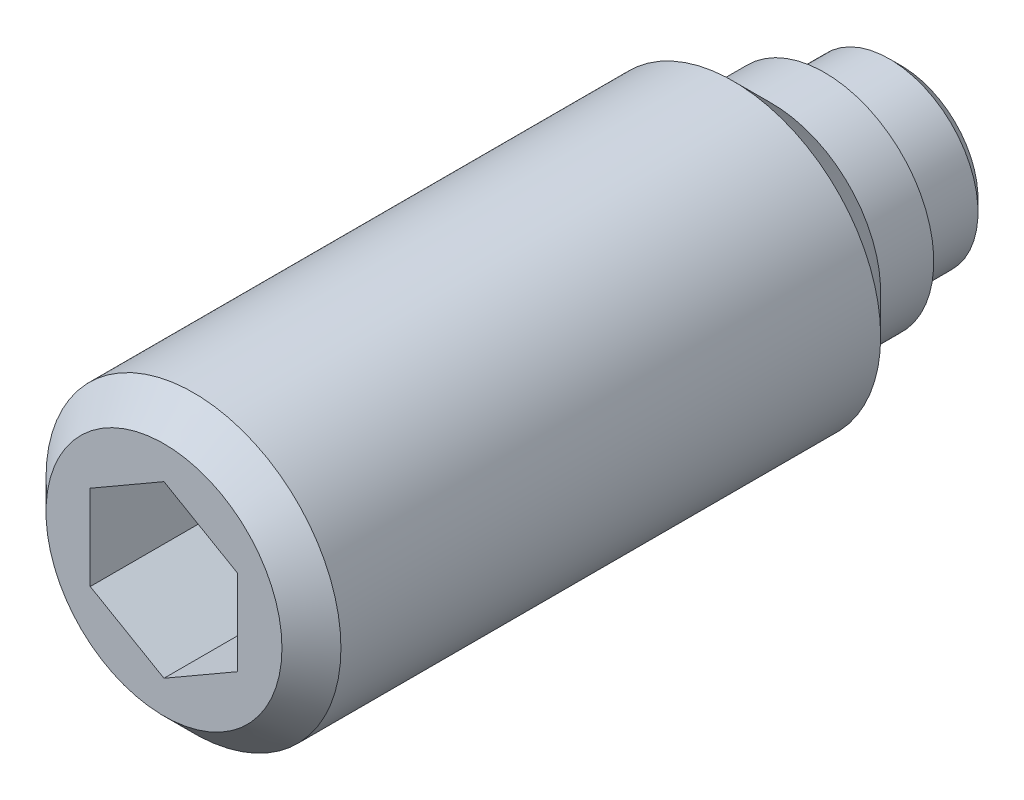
ISO-10303-21;
HEADER;
FILE_DESCRIPTION(('STEP AP214'),'2;1');
FILE_NAME('part.step','',(''),(''),'','','');
FILE_SCHEMA(('AUTOMOTIVE_DESIGN { 1 0 10303 214 1 1 1 1 }'));
ENDSEC;
DATA;
#1=APPLICATION_CONTEXT('core data for automotive mechanical design processes');
#2=APPLICATION_PROTOCOL_DEFINITION('international standard','automotive_design',2000,#1);
#3=PRODUCT_CONTEXT('',#1,'mechanical');
#4=PRODUCT('Part','Part','',(#3));
#5=PRODUCT_RELATED_PRODUCT_CATEGORY('part','',(#4));
#6=PRODUCT_DEFINITION_FORMATION('','',#4);
#7=PRODUCT_DEFINITION_CONTEXT('part definition',#1,'design');
#8=PRODUCT_DEFINITION('design','',#6,#7);
#9=PRODUCT_DEFINITION_SHAPE('','',#8);
#10=(LENGTH_UNIT() NAMED_UNIT(*) SI_UNIT(.MILLI.,.METRE.));
#11=(NAMED_UNIT(*) PLANE_ANGLE_UNIT() SI_UNIT($,.RADIAN.));
#12=(NAMED_UNIT(*) SI_UNIT($,.STERADIAN.) SOLID_ANGLE_UNIT());
#13=UNCERTAINTY_MEASURE_WITH_UNIT(LENGTH_MEASURE(1.E-05),#10,'distance_accuracy_value','');
#14=(GEOMETRIC_REPRESENTATION_CONTEXT(3) GLOBAL_UNCERTAINTY_ASSIGNED_CONTEXT((#13)) GLOBAL_UNIT_ASSIGNED_CONTEXT((#10,
#11,#12)) REPRESENTATION_CONTEXT('',''));
#15=CARTESIAN_POINT('',(0.,0.,0.));
#16=DIRECTION('',(0.,0.,1.));
#17=DIRECTION('',(1.,0.,0.));
#18=AXIS2_PLACEMENT_3D('',#15,#16,#17);
#19=CARTESIAN_POINT('',(0.,0.,1.3));
#20=DIRECTION('',(0.,0.,-1.));
#21=DIRECTION('',(-1.,0.,0.));
#22=AXIS2_PLACEMENT_3D('',#19,#20,#21);
#23=CYLINDRICAL_SURFACE('',#22,2.5);
#24=CARTESIAN_POINT('',(0.,0.,2.85));
#25=DIRECTION('',(0.,0.,-1.));
#26=DIRECTION('',(-1.,0.,0.));
#27=AXIS2_PLACEMENT_3D('',#24,#25,#26);
#28=CIRCLE('',#27,2.5);
#29=CARTESIAN_POINT('',(-2.5,0.,2.85));
#30=VERTEX_POINT('',#29);
#31=EDGE_CURVE('E9',#30,#30,#28,.T.);
#32=ORIENTED_EDGE('',*,*,#31,.F.);
#33=EDGE_LOOP('',(#32));
#34=FACE_BOUND('',#33,.T.);
#35=CARTESIAN_POINT('',(0.,0.,12.));
#36=DIRECTION('',(0.,0.,1.));
#37=DIRECTION('',(1.,0.,0.));
#38=AXIS2_PLACEMENT_3D('',#35,#36,#37);
#39=CIRCLE('',#38,2.5);
#40=CARTESIAN_POINT('',(2.5,0.,12.));
#41=VERTEX_POINT('',#40);
#42=EDGE_CURVE('E115',#41,#41,#39,.T.);
#43=ORIENTED_EDGE('',*,*,#42,.F.);
#44=EDGE_LOOP('',(#43));
#45=FACE_BOUND('',#44,.T.);
#46=ADVANCED_FACE('F14',(#34,#45),#23,.T.);
#47=CARTESIAN_POINT('',(0.,0.,2.85));
#48=DIRECTION('',(0.,0.,1.));
#49=DIRECTION('',(1.,0.,0.));
#50=AXIS2_PLACEMENT_3D('',#47,#48,#49);
#51=CONICAL_SURFACE('',#50,2.5,0.785398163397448);
#52=ORIENTED_EDGE('',*,*,#31,.T.);
#53=EDGE_LOOP('',(#52));
#54=FACE_BOUND('',#53,.T.);
#55=CARTESIAN_POINT('',(0.,0.,2.2));
#56=DIRECTION('',(0.,0.,-1.));
#57=DIRECTION('',(-1.,0.,0.));
#58=AXIS2_PLACEMENT_3D('',#55,#56,#57);
#59=CIRCLE('',#58,1.85);
#60=CARTESIAN_POINT('',(-1.85,0.,2.2));
#61=VERTEX_POINT('',#60);
#62=EDGE_CURVE('E21',#61,#61,#59,.T.);
#63=ORIENTED_EDGE('',*,*,#62,.F.);
#64=EDGE_LOOP('',(#63));
#65=FACE_BOUND('',#64,.T.);
#66=ADVANCED_FACE('F143',(#54,#65),#51,.T.);
#67=CARTESIAN_POINT('',(0.,0.,1.3));
#68=DIRECTION('',(0.,0.,-1.));
#69=DIRECTION('',(-1.,0.,0.));
#70=AXIS2_PLACEMENT_3D('',#67,#68,#69);
#71=CYLINDRICAL_SURFACE('',#70,1.85);
#72=ORIENTED_EDGE('',*,*,#62,.T.);
#73=EDGE_LOOP('',(#72));
#74=FACE_BOUND('',#73,.T.);
#75=CARTESIAN_POINT('',(0.,0.,1.3));
#76=DIRECTION('',(0.,0.,-1.));
#77=DIRECTION('',(-1.,0.,0.));
#78=AXIS2_PLACEMENT_3D('',#75,#76,#77);
#79=CIRCLE('',#78,1.85);
#80=CARTESIAN_POINT('',(-1.85,0.,1.3));
#81=VERTEX_POINT('',#80);
#82=EDGE_CURVE('E135',#81,#81,#79,.T.);
#83=ORIENTED_EDGE('',*,*,#82,.F.);
#84=EDGE_LOOP('',(#83));
#85=FACE_BOUND('',#84,.T.);
#86=ADVANCED_FACE('F140',(#74,#85),#71,.T.);
#87=CARTESIAN_POINT('',(0.,1.85,1.3));
#88=DIRECTION('',(0.,0.,1.));
#89=DIRECTION('',(1.,0.,0.));
#90=AXIS2_PLACEMENT_3D('',#87,#88,#89);
#91=PLANE('',#90);
#92=ORIENTED_EDGE('',*,*,#82,.T.);
#93=EDGE_LOOP('',(#92));
#94=FACE_BOUND('',#93,.T.);
#95=CARTESIAN_POINT('',(0.,0.,1.3));
#96=DIRECTION('',(0.,0.,-1.));
#97=DIRECTION('',(-1.,0.,0.));
#98=AXIS2_PLACEMENT_3D('',#95,#96,#97);
#99=CIRCLE('',#98,1.5);
#100=CARTESIAN_POINT('',(-1.5,0.,1.3));
#101=VERTEX_POINT('',#100);
#102=EDGE_CURVE('E132',#101,#101,#99,.T.);
#103=ORIENTED_EDGE('',*,*,#102,.F.);
#104=EDGE_LOOP('',(#103));
#105=FACE_BOUND('',#104,.T.);
#106=ADVANCED_FACE('F151',(#94,#105),#91,.F.);
#107=CARTESIAN_POINT('',(0.,0.,0.));
#108=DIRECTION('',(0.,0.,-1.));
#109=DIRECTION('',(-1.,0.,0.));
#110=AXIS2_PLACEMENT_3D('',#107,#108,#109);
#111=CYLINDRICAL_SURFACE('',#110,1.5);
#112=CARTESIAN_POINT('',(0.,0.,0.2));
#113=DIRECTION('',(0.,0.,-1.));
#114=DIRECTION('',(-1.,0.,0.));
#115=AXIS2_PLACEMENT_3D('',#112,#113,#114);
#116=CIRCLE('',#115,1.5);
#117=CARTESIAN_POINT('',(-1.5,0.,0.2));
#118=VERTEX_POINT('',#117);
#119=EDGE_CURVE('E129',#118,#118,#116,.T.);
#120=ORIENTED_EDGE('',*,*,#119,.F.);
#121=EDGE_LOOP('',(#120));
#122=FACE_BOUND('',#121,.T.);
#123=ORIENTED_EDGE('',*,*,#102,.T.);
#124=EDGE_LOOP('',(#123));
#125=FACE_BOUND('',#124,.T.);
#126=ADVANCED_FACE('F157',(#122,#125),#111,.T.);
#127=CARTESIAN_POINT('',(0.,0.,0.2));
#128=DIRECTION('',(0.,0.,1.));
#129=DIRECTION('',(1.,0.,0.));
#130=AXIS2_PLACEMENT_3D('',#127,#128,#129);
#131=CONICAL_SURFACE('',#130,1.5,0.785398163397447);
#132=CARTESIAN_POINT('',(0.,0.,0.));
#133=DIRECTION('',(0.,0.,-1.));
#134=DIRECTION('',(-1.,0.,0.));
#135=AXIS2_PLACEMENT_3D('',#132,#133,#134);
#136=CIRCLE('',#135,1.3);
#137=CARTESIAN_POINT('',(-1.3,0.,0.));
#138=VERTEX_POINT('',#137);
#139=EDGE_CURVE('E126',#138,#138,#136,.T.);
#140=ORIENTED_EDGE('',*,*,#139,.F.);
#141=EDGE_LOOP('',(#140));
#142=FACE_BOUND('',#141,.T.);
#143=ORIENTED_EDGE('',*,*,#119,.T.);
#144=EDGE_LOOP('',(#143));
#145=FACE_BOUND('',#144,.T.);
#146=ADVANCED_FACE('F161',(#142,#145),#131,.T.);
#147=CARTESIAN_POINT('',(0.,1.3,0.));
#148=DIRECTION('',(0.,0.,1.));
#149=DIRECTION('',(1.,0.,0.));
#150=AXIS2_PLACEMENT_3D('',#147,#148,#149);
#151=PLANE('',#150);
#152=ORIENTED_EDGE('',*,*,#139,.T.);
#153=EDGE_LOOP('',(#152));
#154=FACE_BOUND('',#153,.T.);
#155=ADVANCED_FACE('F165',(#154),#151,.F.);
#156=CARTESIAN_POINT('',(0.,0.,12.5));
#157=DIRECTION('',(0.,0.,1.));
#158=DIRECTION('',(1.,0.,0.));
#159=AXIS2_PLACEMENT_3D('',#156,#157,#158);
#160=PLANE('',#159);
#161=DIRECTION('',(0.866025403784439,-0.5,0.));
#162=VECTOR('',#161,1.);
#163=CARTESIAN_POINT('',(-1.25,-0.721687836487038,12.5));
#164=LINE('',#163,#162);
#165=CARTESIAN_POINT('',(-1.25,-0.721687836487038,12.5));
#166=VERTEX_POINT('',#165);
#167=CARTESIAN_POINT('',(0.,-1.44337567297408,12.5));
#168=VERTEX_POINT('',#167);
#169=EDGE_CURVE('E28',#166,#168,#164,.T.);
#170=ORIENTED_EDGE('',*,*,#169,.F.);
#171=DIRECTION('',(0.,-1.,0.));
#172=VECTOR('',#171,1.);
#173=CARTESIAN_POINT('',(-1.25,0.721687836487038,12.5));
#174=LINE('',#173,#172);
#175=CARTESIAN_POINT('',(-1.25,0.721687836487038,12.5));
#176=VERTEX_POINT('',#175);
#177=EDGE_CURVE('E111',#176,#166,#174,.T.);
#178=ORIENTED_EDGE('',*,*,#177,.F.);
#179=DIRECTION('',(-0.866025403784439,-0.5,0.));
#180=VECTOR('',#179,1.);
#181=CARTESIAN_POINT('',(0.,1.44337567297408,12.5));
#182=LINE('',#181,#180);
#183=CARTESIAN_POINT('',(0.,1.44337567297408,12.5));
#184=VERTEX_POINT('',#183);
#185=EDGE_CURVE('E109',#184,#176,#182,.T.);
#186=ORIENTED_EDGE('',*,*,#185,.F.);
#187=DIRECTION('',(-0.866025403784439,0.5,0.));
#188=VECTOR('',#187,1.);
#189=CARTESIAN_POINT('',(1.25,0.721687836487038,12.5));
#190=LINE('',#189,#188);
#191=CARTESIAN_POINT('',(1.25,0.721687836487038,12.5));
#192=VERTEX_POINT('',#191);
#193=EDGE_CURVE('E76',#192,#184,#190,.T.);
#194=ORIENTED_EDGE('',*,*,#193,.F.);
#195=DIRECTION('',(0.,1.,0.));
#196=VECTOR('',#195,1.);
#197=CARTESIAN_POINT('',(1.25,-0.721687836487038,12.5));
#198=LINE('',#197,#196);
#199=CARTESIAN_POINT('',(1.25,-0.721687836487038,12.5));
#200=VERTEX_POINT('',#199);
#201=EDGE_CURVE('E105',#200,#192,#198,.T.);
#202=ORIENTED_EDGE('',*,*,#201,.F.);
#203=DIRECTION('',(0.866025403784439,0.5,0.));
#204=VECTOR('',#203,1.);
#205=CARTESIAN_POINT('',(0.,-1.44337567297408,12.5));
#206=LINE('',#205,#204);
#207=EDGE_CURVE('E102',#168,#200,#206,.T.);
#208=ORIENTED_EDGE('',*,*,#207,.F.);
#209=EDGE_LOOP('',(#170,#178,#186,#194,#202,#208));
#210=FACE_BOUND('',#209,.T.);
#211=CARTESIAN_POINT('',(0.,0.,12.5));
#212=DIRECTION('',(0.,0.,1.));
#213=DIRECTION('',(1.,0.,0.));
#214=AXIS2_PLACEMENT_3D('',#211,#212,#213);
#215=CIRCLE('',#214,2.);
#216=CARTESIAN_POINT('',(2.,0.,12.5));
#217=VERTEX_POINT('',#216);
#218=EDGE_CURVE('E123',#217,#217,#215,.T.);
#219=ORIENTED_EDGE('',*,*,#218,.T.);
#220=EDGE_LOOP('',(#219));
#221=FACE_BOUND('',#220,.T.);
#222=ADVANCED_FACE('F169',(#210,#221),#160,.T.);
#223=CARTESIAN_POINT('',(0.,0.,12.5));
#224=DIRECTION('',(0.,0.,-1.));
#225=DIRECTION('',(-1.,0.,0.));
#226=AXIS2_PLACEMENT_3D('',#223,#224,#225);
#227=CONICAL_SURFACE('',#226,2.,0.785398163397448);
#228=ORIENTED_EDGE('',*,*,#42,.T.);
#229=EDGE_LOOP('',(#228));
#230=FACE_BOUND('',#229,.T.);
#231=ORIENTED_EDGE('',*,*,#218,.F.);
#232=EDGE_LOOP('',(#231));
#233=FACE_BOUND('',#232,.T.);
#234=ADVANCED_FACE('F173',(#230,#233),#227,.T.);
#235=CARTESIAN_POINT('',(-1.25,-0.721687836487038,9.5));
#236=DIRECTION('',(-0.5,-0.866025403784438,0.));
#237=DIRECTION('',(0.866025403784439,-0.5,0.));
#238=AXIS2_PLACEMENT_3D('',#235,#236,#237);
#239=PLANE('',#238);
#240=ORIENTED_EDGE('',*,*,#169,.T.);
#241=DIRECTION('',(0.,0.,1.));
#242=VECTOR('',#241,1.);
#243=CARTESIAN_POINT('',(0.,-1.44337567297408,9.5));
#244=LINE('',#243,#242);
#245=CARTESIAN_POINT('',(0.,-1.44337567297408,9.5));
#246=VERTEX_POINT('',#245);
#247=EDGE_CURVE('E58',#246,#168,#244,.T.);
#248=ORIENTED_EDGE('',*,*,#247,.F.);
#249=DIRECTION('',(0.866025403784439,-0.5,0.));
#250=VECTOR('',#249,1.);
#251=CARTESIAN_POINT('',(-1.25,-0.721687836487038,9.5));
#252=LINE('',#251,#250);
#253=CARTESIAN_POINT('',(-1.25,-0.721687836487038,9.5));
#254=VERTEX_POINT('',#253);
#255=EDGE_CURVE('E113',#254,#246,#252,.T.);
#256=ORIENTED_EDGE('',*,*,#255,.F.);
#257=DIRECTION('',(0.,0.,1.));
#258=VECTOR('',#257,1.);
#259=CARTESIAN_POINT('',(-1.25,-0.721687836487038,9.5));
#260=LINE('',#259,#258);
#261=EDGE_CURVE('E36',#254,#166,#260,.T.);
#262=ORIENTED_EDGE('',*,*,#261,.T.);
#263=EDGE_LOOP('',(#240,#248,#256,#262));
#264=FACE_BOUND('',#263,.T.);
#265=ADVANCED_FACE('F177',(#264),#239,.F.);
#266=CARTESIAN_POINT('',(-1.25,0.721687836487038,9.5));
#267=DIRECTION('',(-1.,0.,0.));
#268=DIRECTION('',(0.,0.,1.));
#269=AXIS2_PLACEMENT_3D('',#266,#267,#268);
#270=PLANE('',#269);
#271=ORIENTED_EDGE('',*,*,#177,.T.);
#272=ORIENTED_EDGE('',*,*,#261,.F.);
#273=DIRECTION('',(0.,-1.,0.));
#274=VECTOR('',#273,1.);
#275=CARTESIAN_POINT('',(-1.25,0.721687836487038,9.5));
#276=LINE('',#275,#274);
#277=CARTESIAN_POINT('',(-1.25,0.721687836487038,9.5));
#278=VERTEX_POINT('',#277);
#279=EDGE_CURVE('E88',#278,#254,#276,.T.);
#280=ORIENTED_EDGE('',*,*,#279,.F.);
#281=DIRECTION('',(0.,0.,1.));
#282=VECTOR('',#281,1.);
#283=CARTESIAN_POINT('',(-1.25,0.721687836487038,9.5));
#284=LINE('',#283,#282);
#285=EDGE_CURVE('E80',#278,#176,#284,.T.);
#286=ORIENTED_EDGE('',*,*,#285,.T.);
#287=EDGE_LOOP('',(#271,#272,#280,#286));
#288=FACE_BOUND('',#287,.T.);
#289=ADVANCED_FACE('F181',(#288),#270,.F.);
#290=CARTESIAN_POINT('',(0.,1.44337567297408,9.5));
#291=DIRECTION('',(-0.5,0.866025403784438,0.));
#292=DIRECTION('',(-0.866025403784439,-0.5,0.));
#293=AXIS2_PLACEMENT_3D('',#290,#291,#292);
#294=PLANE('',#293);
#295=ORIENTED_EDGE('',*,*,#185,.T.);
#296=ORIENTED_EDGE('',*,*,#285,.F.);
#297=DIRECTION('',(-0.866025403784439,-0.5,0.));
#298=VECTOR('',#297,1.);
#299=CARTESIAN_POINT('',(0.,1.44337567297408,9.5));
#300=LINE('',#299,#298);
#301=CARTESIAN_POINT('',(0.,1.44337567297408,9.5));
#302=VERTEX_POINT('',#301);
#303=EDGE_CURVE('E84',#302,#278,#300,.T.);
#304=ORIENTED_EDGE('',*,*,#303,.F.);
#305=DIRECTION('',(0.,0.,1.));
#306=VECTOR('',#305,1.);
#307=CARTESIAN_POINT('',(0.,1.44337567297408,9.5));
#308=LINE('',#307,#306);
#309=EDGE_CURVE('E69',#302,#184,#308,.T.);
#310=ORIENTED_EDGE('',*,*,#309,.T.);
#311=EDGE_LOOP('',(#295,#296,#304,#310));
#312=FACE_BOUND('',#311,.T.);
#313=ADVANCED_FACE('F85',(#312),#294,.F.);
#314=CARTESIAN_POINT('',(1.25,0.721687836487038,9.5));
#315=DIRECTION('',(0.5,0.866025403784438,0.));
#316=DIRECTION('',(-0.866025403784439,0.5,0.));
#317=AXIS2_PLACEMENT_3D('',#314,#315,#316);
#318=PLANE('',#317);
#319=ORIENTED_EDGE('',*,*,#193,.T.);
#320=ORIENTED_EDGE('',*,*,#309,.F.);
#321=DIRECTION('',(-0.866025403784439,0.5,0.));
#322=VECTOR('',#321,1.);
#323=CARTESIAN_POINT('',(1.25,0.721687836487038,9.5));
#324=LINE('',#323,#322);
#325=CARTESIAN_POINT('',(1.25,0.721687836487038,9.5));
#326=VERTEX_POINT('',#325);
#327=EDGE_CURVE('E73',#326,#302,#324,.T.);
#328=ORIENTED_EDGE('',*,*,#327,.F.);
#329=DIRECTION('',(0.,0.,1.));
#330=VECTOR('',#329,1.);
#331=CARTESIAN_POINT('',(1.25,0.721687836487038,9.5));
#332=LINE('',#331,#330);
#333=EDGE_CURVE('E81',#326,#192,#332,.T.);
#334=ORIENTED_EDGE('',*,*,#333,.T.);
#335=EDGE_LOOP('',(#319,#320,#328,#334));
#336=FACE_BOUND('',#335,.T.);
#337=ADVANCED_FACE('F71',(#336),#318,.F.);
#338=CARTESIAN_POINT('',(1.25,-0.721687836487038,9.5));
#339=DIRECTION('',(1.,0.,0.));
#340=DIRECTION('',(0.,0.,-1.));
#341=AXIS2_PLACEMENT_3D('',#338,#339,#340);
#342=PLANE('',#341);
#343=ORIENTED_EDGE('',*,*,#201,.T.);
#344=ORIENTED_EDGE('',*,*,#333,.F.);
#345=DIRECTION('',(0.,1.,0.));
#346=VECTOR('',#345,1.);
#347=CARTESIAN_POINT('',(1.25,-0.721687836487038,9.5));
#348=LINE('',#347,#346);
#349=CARTESIAN_POINT('',(1.25,-0.721687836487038,9.5));
#350=VERTEX_POINT('',#349);
#351=EDGE_CURVE('E94',#350,#326,#348,.T.);
#352=ORIENTED_EDGE('',*,*,#351,.F.);
#353=DIRECTION('',(0.,0.,1.));
#354=VECTOR('',#353,1.);
#355=CARTESIAN_POINT('',(1.25,-0.721687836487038,9.5));
#356=LINE('',#355,#354);
#357=EDGE_CURVE('E118',#350,#200,#356,.T.);
#358=ORIENTED_EDGE('',*,*,#357,.T.);
#359=EDGE_LOOP('',(#343,#344,#352,#358));
#360=FACE_BOUND('',#359,.T.);
#361=ADVANCED_FACE('F185',(#360),#342,.F.);
#362=CARTESIAN_POINT('',(0.,-1.44337567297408,9.5));
#363=DIRECTION('',(0.5,-0.866025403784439,0.));
#364=DIRECTION('',(0.866025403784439,0.5,0.));
#365=AXIS2_PLACEMENT_3D('',#362,#363,#364);
#366=PLANE('',#365);
#367=ORIENTED_EDGE('',*,*,#207,.T.);
#368=ORIENTED_EDGE('',*,*,#357,.F.);
#369=DIRECTION('',(0.866025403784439,0.5,0.));
#370=VECTOR('',#369,1.);
#371=CARTESIAN_POINT('',(0.,-1.44337567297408,9.5));
#372=LINE('',#371,#370);
#373=EDGE_CURVE('E96',#246,#350,#372,.T.);
#374=ORIENTED_EDGE('',*,*,#373,.F.);
#375=ORIENTED_EDGE('',*,*,#247,.T.);
#376=EDGE_LOOP('',(#367,#368,#374,#375));
#377=FACE_BOUND('',#376,.T.);
#378=ADVANCED_FACE('F182',(#377),#366,.F.);
#379=CARTESIAN_POINT('',(0.,0.,9.5));
#380=DIRECTION('',(0.,0.,1.));
#381=DIRECTION('',(1.,0.,0.));
#382=AXIS2_PLACEMENT_3D('',#379,#380,#381);
#383=PLANE('',#382);
#384=ORIENTED_EDGE('',*,*,#255,.T.);
#385=ORIENTED_EDGE('',*,*,#373,.T.);
#386=ORIENTED_EDGE('',*,*,#351,.T.);
#387=ORIENTED_EDGE('',*,*,#327,.T.);
#388=ORIENTED_EDGE('',*,*,#303,.T.);
#389=ORIENTED_EDGE('',*,*,#279,.T.);
#390=EDGE_LOOP('',(#384,#385,#386,#387,#388,#389));
#391=FACE_BOUND('',#390,.T.);
#392=ADVANCED_FACE('F91',(#391),#383,.T.);
#393=CLOSED_SHELL('',(#46,#66,#86,#106,#126,#146,#155,#222,#234,#265,#289,#313,#337,#361,#378,#392));
#394=MANIFOLD_SOLID_BREP('B1',#393);
#395=ADVANCED_BREP_SHAPE_REPRESENTATION('',(#18,#394),#14);
#396=SHAPE_DEFINITION_REPRESENTATION(#9,#395);
ENDSEC;
END-ISO-10303-21;
